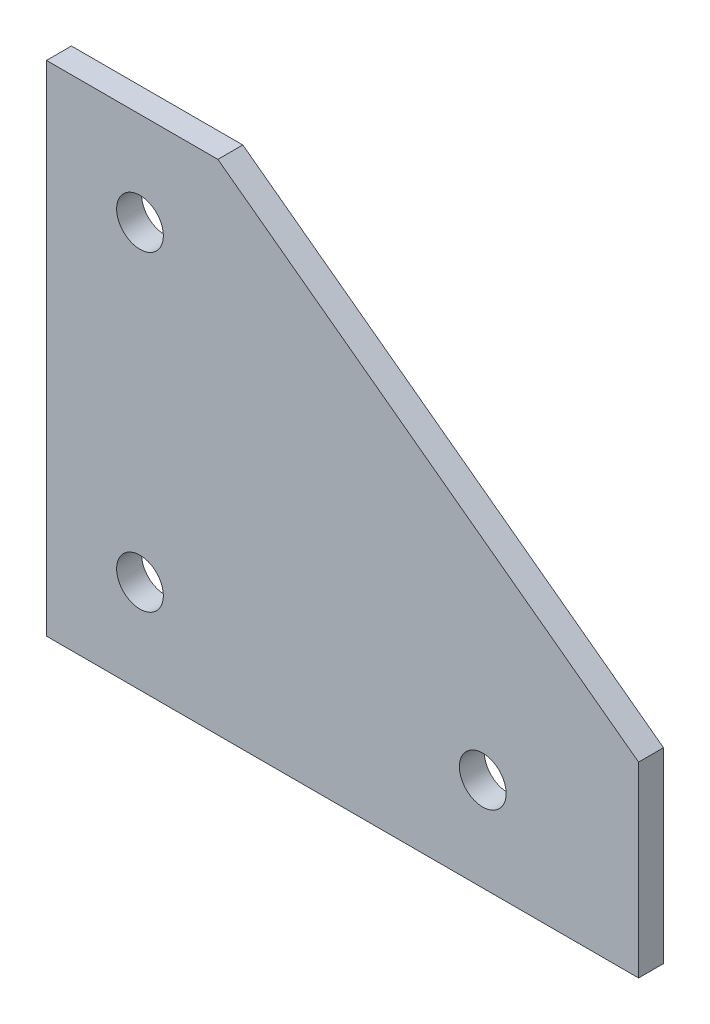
ISO-10303-21;
HEADER;
FILE_DESCRIPTION(('STEP AP214'),'2;1');
FILE_NAME('part.step','',(''),(''),'','','');
FILE_SCHEMA(('AUTOMOTIVE_DESIGN { 1 0 10303 214 1 1 1 1 }'));
ENDSEC;
DATA;
#1=APPLICATION_CONTEXT('core data for automotive mechanical design processes');
#2=APPLICATION_PROTOCOL_DEFINITION('international standard','automotive_design',2000,#1);
#3=PRODUCT_CONTEXT('',#1,'mechanical');
#4=PRODUCT('Part','Part','',(#3));
#5=PRODUCT_RELATED_PRODUCT_CATEGORY('part','',(#4));
#6=PRODUCT_DEFINITION_FORMATION('','',#4);
#7=PRODUCT_DEFINITION_CONTEXT('part definition',#1,'design');
#8=PRODUCT_DEFINITION('design','',#6,#7);
#9=PRODUCT_DEFINITION_SHAPE('','',#8);
#10=(LENGTH_UNIT() NAMED_UNIT(*) SI_UNIT(.MILLI.,.METRE.));
#11=(NAMED_UNIT(*) PLANE_ANGLE_UNIT() SI_UNIT($,.RADIAN.));
#12=(NAMED_UNIT(*) SI_UNIT($,.STERADIAN.) SOLID_ANGLE_UNIT());
#13=UNCERTAINTY_MEASURE_WITH_UNIT(LENGTH_MEASURE(1.E-05),#10,'distance_accuracy_value','');
#14=(GEOMETRIC_REPRESENTATION_CONTEXT(3) GLOBAL_UNCERTAINTY_ASSIGNED_CONTEXT((#13)) GLOBAL_UNIT_ASSIGNED_CONTEXT((#10,
#11,#12)) REPRESENTATION_CONTEXT('',''));
#15=CARTESIAN_POINT('',(0.,0.,0.));
#16=DIRECTION('',(0.,0.,1.));
#17=DIRECTION('',(1.,0.,0.));
#18=AXIS2_PLACEMENT_3D('',#15,#16,#17);
#19=CARTESIAN_POINT('',(0.,0.,8.));
#20=DIRECTION('',(0.,0.,1.));
#21=DIRECTION('',(1.,0.,0.));
#22=AXIS2_PLACEMENT_3D('',#19,#20,#21);
#23=PLANE('',#22);
#24=CARTESIAN_POINT('',(140.,30.,8.));
#25=DIRECTION('',(0.,0.,1.));
#26=DIRECTION('',(1.,0.,0.));
#27=AXIS2_PLACEMENT_3D('',#24,#25,#26);
#28=CIRCLE('',#27,7.50000000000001);
#29=CARTESIAN_POINT('',(147.5,30.,8.));
#30=VERTEX_POINT('',#29);
#31=EDGE_CURVE('E137',#30,#30,#28,.T.);
#32=ORIENTED_EDGE('',*,*,#31,.F.);
#33=EDGE_LOOP('',(#32));
#34=FACE_BOUND('',#33,.T.);
#35=DIRECTION('',(0.,-1.,0.));
#36=VECTOR('',#35,1.);
#37=CARTESIAN_POINT('',(0.,160.,8.));
#38=LINE('',#37,#36);
#39=CARTESIAN_POINT('',(0.,160.,8.));
#40=VERTEX_POINT('',#39);
#41=CARTESIAN_POINT('',(0.,0.,8.));
#42=VERTEX_POINT('',#41);
#43=EDGE_CURVE('E106',#40,#42,#38,.T.);
#44=ORIENTED_EDGE('',*,*,#43,.T.);
#45=DIRECTION('',(1.,0.,0.));
#46=VECTOR('',#45,1.);
#47=CARTESIAN_POINT('',(0.,0.,8.));
#48=LINE('',#47,#46);
#49=CARTESIAN_POINT('',(190.,0.,8.));
#50=VERTEX_POINT('',#49);
#51=EDGE_CURVE('E89',#42,#50,#48,.T.);
#52=ORIENTED_EDGE('',*,*,#51,.T.);
#53=DIRECTION('',(0.,1.,0.));
#54=VECTOR('',#53,1.);
#55=CARTESIAN_POINT('',(190.,0.,8.));
#56=LINE('',#55,#54);
#57=CARTESIAN_POINT('',(190.,60.,8.));
#58=VERTEX_POINT('',#57);
#59=EDGE_CURVE('E109',#50,#58,#56,.T.);
#60=ORIENTED_EDGE('',*,*,#59,.T.);
#61=DIRECTION('',(-0.803557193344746,0.595227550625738,0.));
#62=VECTOR('',#61,1.);
#63=CARTESIAN_POINT('',(190.,60.,8.));
#64=LINE('',#63,#62);
#65=CARTESIAN_POINT('',(55.,160.,8.));
#66=VERTEX_POINT('',#65);
#67=EDGE_CURVE('E48',#58,#66,#64,.T.);
#68=ORIENTED_EDGE('',*,*,#67,.T.);
#69=DIRECTION('',(-1.,0.,0.));
#70=VECTOR('',#69,1.);
#71=CARTESIAN_POINT('',(55.,160.,8.));
#72=LINE('',#71,#70);
#73=EDGE_CURVE('E43',#66,#40,#72,.T.);
#74=ORIENTED_EDGE('',*,*,#73,.T.);
#75=EDGE_LOOP('',(#44,#52,#60,#68,#74));
#76=FACE_BOUND('',#75,.T.);
#77=CARTESIAN_POINT('',(30.,30.,8.));
#78=DIRECTION('',(0.,0.,1.));
#79=DIRECTION('',(1.,0.,0.));
#80=AXIS2_PLACEMENT_3D('',#77,#78,#79);
#81=CIRCLE('',#80,7.5);
#82=CARTESIAN_POINT('',(37.5,30.,8.));
#83=VERTEX_POINT('',#82);
#84=EDGE_CURVE('E94',#83,#83,#81,.T.);
#85=ORIENTED_EDGE('',*,*,#84,.F.);
#86=EDGE_LOOP('',(#85));
#87=FACE_BOUND('',#86,.T.);
#88=CARTESIAN_POINT('',(30.,130.,8.));
#89=DIRECTION('',(0.,0.,1.));
#90=DIRECTION('',(1.,0.,0.));
#91=AXIS2_PLACEMENT_3D('',#88,#89,#90);
#92=CIRCLE('',#91,7.5);
#93=CARTESIAN_POINT('',(37.5,130.,8.));
#94=VERTEX_POINT('',#93);
#95=EDGE_CURVE('E131',#94,#94,#92,.T.);
#96=ORIENTED_EDGE('',*,*,#95,.F.);
#97=EDGE_LOOP('',(#96));
#98=FACE_BOUND('',#97,.T.);
#99=ADVANCED_FACE('F28',(#34,#76,#87,#98),#23,.T.);
#100=CARTESIAN_POINT('',(0.,0.,0.));
#101=DIRECTION('',(0.,0.,1.));
#102=DIRECTION('',(1.,0.,0.));
#103=AXIS2_PLACEMENT_3D('',#100,#101,#102);
#104=PLANE('',#103);
#105=CARTESIAN_POINT('',(140.,30.,0.));
#106=DIRECTION('',(0.,0.,1.));
#107=DIRECTION('',(1.,0.,0.));
#108=AXIS2_PLACEMENT_3D('',#105,#106,#107);
#109=CIRCLE('',#108,7.50000000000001);
#110=CARTESIAN_POINT('',(147.5,30.,0.));
#111=VERTEX_POINT('',#110);
#112=EDGE_CURVE('E133',#111,#111,#109,.T.);
#113=ORIENTED_EDGE('',*,*,#112,.T.);
#114=EDGE_LOOP('',(#113));
#115=FACE_BOUND('',#114,.T.);
#116=DIRECTION('',(0.,-1.,0.));
#117=VECTOR('',#116,1.);
#118=CARTESIAN_POINT('',(0.,160.,0.));
#119=LINE('',#118,#117);
#120=CARTESIAN_POINT('',(0.,160.,0.));
#121=VERTEX_POINT('',#120);
#122=CARTESIAN_POINT('',(0.,0.,0.));
#123=VERTEX_POINT('',#122);
#124=EDGE_CURVE('E80',#121,#123,#119,.T.);
#125=ORIENTED_EDGE('',*,*,#124,.F.);
#126=DIRECTION('',(-1.,0.,0.));
#127=VECTOR('',#126,1.);
#128=CARTESIAN_POINT('',(55.,160.,0.));
#129=LINE('',#128,#127);
#130=CARTESIAN_POINT('',(55.,160.,0.));
#131=VERTEX_POINT('',#130);
#132=EDGE_CURVE('E104',#131,#121,#129,.T.);
#133=ORIENTED_EDGE('',*,*,#132,.F.);
#134=DIRECTION('',(-0.803557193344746,0.595227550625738,0.));
#135=VECTOR('',#134,1.);
#136=CARTESIAN_POINT('',(190.,60.,0.));
#137=LINE('',#136,#135);
#138=CARTESIAN_POINT('',(190.,60.,0.));
#139=VERTEX_POINT('',#138);
#140=EDGE_CURVE('E102',#139,#131,#137,.T.);
#141=ORIENTED_EDGE('',*,*,#140,.F.);
#142=DIRECTION('',(0.,1.,0.));
#143=VECTOR('',#142,1.);
#144=CARTESIAN_POINT('',(190.,0.,0.));
#145=LINE('',#144,#143);
#146=CARTESIAN_POINT('',(190.,0.,0.));
#147=VERTEX_POINT('',#146);
#148=EDGE_CURVE('E82',#147,#139,#145,.T.);
#149=ORIENTED_EDGE('',*,*,#148,.F.);
#150=DIRECTION('',(1.,0.,0.));
#151=VECTOR('',#150,1.);
#152=CARTESIAN_POINT('',(0.,0.,0.));
#153=LINE('',#152,#151);
#154=EDGE_CURVE('E75',#123,#147,#153,.T.);
#155=ORIENTED_EDGE('',*,*,#154,.F.);
#156=EDGE_LOOP('',(#125,#133,#141,#149,#155));
#157=FACE_BOUND('',#156,.T.);
#158=CARTESIAN_POINT('',(30.,30.,0.));
#159=DIRECTION('',(0.,0.,1.));
#160=DIRECTION('',(1.,0.,0.));
#161=AXIS2_PLACEMENT_3D('',#158,#159,#160);
#162=CIRCLE('',#161,7.5);
#163=CARTESIAN_POINT('',(37.5,30.,0.));
#164=VERTEX_POINT('',#163);
#165=EDGE_CURVE('E97',#164,#164,#162,.T.);
#166=ORIENTED_EDGE('',*,*,#165,.T.);
#167=EDGE_LOOP('',(#166));
#168=FACE_BOUND('',#167,.T.);
#169=CARTESIAN_POINT('',(30.,130.,0.));
#170=DIRECTION('',(0.,0.,1.));
#171=DIRECTION('',(1.,0.,0.));
#172=AXIS2_PLACEMENT_3D('',#169,#170,#171);
#173=CIRCLE('',#172,7.5);
#174=CARTESIAN_POINT('',(37.5,130.,0.));
#175=VERTEX_POINT('',#174);
#176=EDGE_CURVE('E134',#175,#175,#173,.T.);
#177=ORIENTED_EDGE('',*,*,#176,.T.);
#178=EDGE_LOOP('',(#177));
#179=FACE_BOUND('',#178,.T.);
#180=ADVANCED_FACE('F76',(#115,#157,#168,#179),#104,.F.);
#181=CARTESIAN_POINT('',(0.,160.,8.));
#182=DIRECTION('',(1.,0.,0.));
#183=DIRECTION('',(0.,1.,0.));
#184=AXIS2_PLACEMENT_3D('',#181,#182,#183);
#185=PLANE('',#184);
#186=ORIENTED_EDGE('',*,*,#124,.T.);
#187=DIRECTION('',(0.,0.,-1.));
#188=VECTOR('',#187,1.);
#189=CARTESIAN_POINT('',(0.,0.,8.));
#190=LINE('',#189,#188);
#191=EDGE_CURVE('E11',#42,#123,#190,.T.);
#192=ORIENTED_EDGE('',*,*,#191,.F.);
#193=ORIENTED_EDGE('',*,*,#43,.F.);
#194=DIRECTION('',(0.,0.,-1.));
#195=VECTOR('',#194,1.);
#196=CARTESIAN_POINT('',(0.,160.,8.));
#197=LINE('',#196,#195);
#198=EDGE_CURVE('E93',#40,#121,#197,.T.);
#199=ORIENTED_EDGE('',*,*,#198,.T.);
#200=EDGE_LOOP('',(#186,#192,#193,#199));
#201=FACE_BOUND('',#200,.T.);
#202=ADVANCED_FACE('F30',(#201),#185,.F.);
#203=CARTESIAN_POINT('',(0.,0.,8.));
#204=DIRECTION('',(0.,1.,0.));
#205=DIRECTION('',(0.,0.,1.));
#206=AXIS2_PLACEMENT_3D('',#203,#204,#205);
#207=PLANE('',#206);
#208=ORIENTED_EDGE('',*,*,#154,.T.);
#209=DIRECTION('',(0.,0.,-1.));
#210=VECTOR('',#209,1.);
#211=CARTESIAN_POINT('',(190.,0.,8.));
#212=LINE('',#211,#210);
#213=EDGE_CURVE('E36',#50,#147,#212,.T.);
#214=ORIENTED_EDGE('',*,*,#213,.F.);
#215=ORIENTED_EDGE('',*,*,#51,.F.);
#216=ORIENTED_EDGE('',*,*,#191,.T.);
#217=EDGE_LOOP('',(#208,#214,#215,#216));
#218=FACE_BOUND('',#217,.T.);
#219=ADVANCED_FACE('F88',(#218),#207,.F.);
#220=CARTESIAN_POINT('',(190.,0.,8.));
#221=DIRECTION('',(-1.,0.,0.));
#222=DIRECTION('',(0.,0.,1.));
#223=AXIS2_PLACEMENT_3D('',#220,#221,#222);
#224=PLANE('',#223);
#225=ORIENTED_EDGE('',*,*,#148,.T.);
#226=DIRECTION('',(0.,0.,-1.));
#227=VECTOR('',#226,1.);
#228=CARTESIAN_POINT('',(190.,60.,8.));
#229=LINE('',#228,#227);
#230=EDGE_CURVE('E117',#58,#139,#229,.T.);
#231=ORIENTED_EDGE('',*,*,#230,.F.);
#232=ORIENTED_EDGE('',*,*,#59,.F.);
#233=ORIENTED_EDGE('',*,*,#213,.T.);
#234=EDGE_LOOP('',(#225,#231,#232,#233));
#235=FACE_BOUND('',#234,.T.);
#236=ADVANCED_FACE('F121',(#235),#224,.F.);
#237=CARTESIAN_POINT('',(190.,60.,8.));
#238=DIRECTION('',(-0.595227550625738,-0.803557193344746,0.));
#239=DIRECTION('',(0.803557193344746,-0.595227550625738,0.));
#240=AXIS2_PLACEMENT_3D('',#237,#238,#239);
#241=PLANE('',#240);
#242=ORIENTED_EDGE('',*,*,#140,.T.);
#243=DIRECTION('',(0.,0.,-1.));
#244=VECTOR('',#243,1.);
#245=CARTESIAN_POINT('',(55.,160.,8.));
#246=LINE('',#245,#244);
#247=EDGE_CURVE('E114',#66,#131,#246,.T.);
#248=ORIENTED_EDGE('',*,*,#247,.F.);
#249=ORIENTED_EDGE('',*,*,#67,.F.);
#250=ORIENTED_EDGE('',*,*,#230,.T.);
#251=EDGE_LOOP('',(#242,#248,#249,#250));
#252=FACE_BOUND('',#251,.T.);
#253=ADVANCED_FACE('F160',(#252),#241,.F.);
#254=CARTESIAN_POINT('',(55.,160.,8.));
#255=DIRECTION('',(0.,-1.,0.));
#256=DIRECTION('',(0.,0.,-1.));
#257=AXIS2_PLACEMENT_3D('',#254,#255,#256);
#258=PLANE('',#257);
#259=ORIENTED_EDGE('',*,*,#132,.T.);
#260=ORIENTED_EDGE('',*,*,#198,.F.);
#261=ORIENTED_EDGE('',*,*,#73,.F.);
#262=ORIENTED_EDGE('',*,*,#247,.T.);
#263=EDGE_LOOP('',(#259,#260,#261,#262));
#264=FACE_BOUND('',#263,.T.);
#265=ADVANCED_FACE('F150',(#264),#258,.F.);
#266=CARTESIAN_POINT('',(30.,30.,8.));
#267=DIRECTION('',(0.,0.,-1.));
#268=DIRECTION('',(-1.,0.,0.));
#269=AXIS2_PLACEMENT_3D('',#266,#267,#268);
#270=CYLINDRICAL_SURFACE('',#269,7.5);
#271=ORIENTED_EDGE('',*,*,#84,.T.);
#272=EDGE_LOOP('',(#271));
#273=FACE_BOUND('',#272,.T.);
#274=ORIENTED_EDGE('',*,*,#165,.F.);
#275=EDGE_LOOP('',(#274));
#276=FACE_BOUND('',#275,.T.);
#277=ADVANCED_FACE('F147',(#273,#276),#270,.F.);
#278=CARTESIAN_POINT('',(140.,30.,8.));
#279=DIRECTION('',(0.,0.,-1.));
#280=DIRECTION('',(-1.,0.,0.));
#281=AXIS2_PLACEMENT_3D('',#278,#279,#280);
#282=CYLINDRICAL_SURFACE('',#281,7.50000000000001);
#283=ORIENTED_EDGE('',*,*,#31,.T.);
#284=EDGE_LOOP('',(#283));
#285=FACE_BOUND('',#284,.T.);
#286=ORIENTED_EDGE('',*,*,#112,.F.);
#287=EDGE_LOOP('',(#286));
#288=FACE_BOUND('',#287,.T.);
#289=ADVANCED_FACE('F149',(#285,#288),#282,.F.);
#290=CARTESIAN_POINT('',(30.,130.,8.));
#291=DIRECTION('',(0.,0.,-1.));
#292=DIRECTION('',(-1.,0.,0.));
#293=AXIS2_PLACEMENT_3D('',#290,#291,#292);
#294=CYLINDRICAL_SURFACE('',#293,7.5);
#295=ORIENTED_EDGE('',*,*,#95,.T.);
#296=EDGE_LOOP('',(#295));
#297=FACE_BOUND('',#296,.T.);
#298=ORIENTED_EDGE('',*,*,#176,.F.);
#299=EDGE_LOOP('',(#298));
#300=FACE_BOUND('',#299,.T.);
#301=ADVANCED_FACE('F157',(#297,#300),#294,.F.);
#302=CLOSED_SHELL('',(#99,#180,#202,#219,#236,#253,#265,#277,#289,#301));
#303=MANIFOLD_SOLID_BREP('B2',#302);
#304=ADVANCED_BREP_SHAPE_REPRESENTATION('',(#18,#303),#14);
#305=SHAPE_DEFINITION_REPRESENTATION(#9,#304);
ENDSEC;
END-ISO-10303-21;
